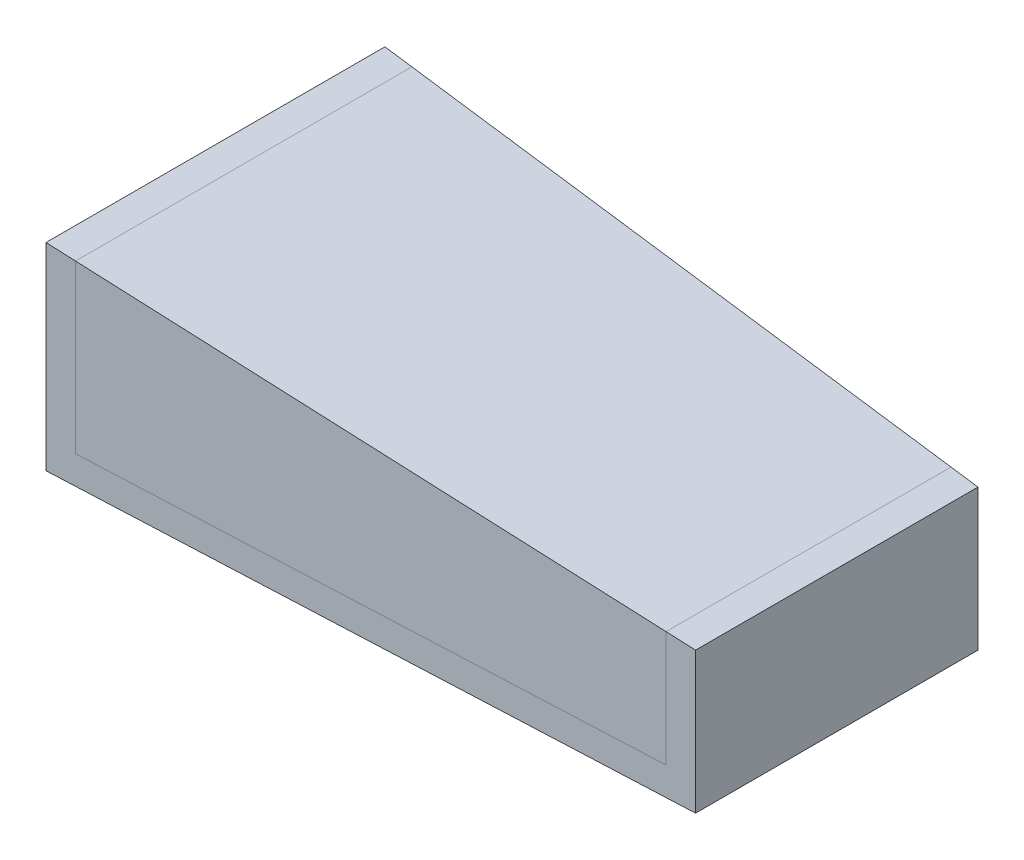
from build123d import *

# Parameters (mm, degrees)
BOSS_EXTRUDE1_DEPTH    = 60
CUT_EXTRUDE1_DEPTH     = 120
SPLIT1_SURFACE_1_BACK  = 261.192
SPLIT1_SURFACE_1_DEPTH = 522.384
SPLIT1_SURFACE_2_BACK  = 261.192
SPLIT1_SURFACE_2_DEPTH = 522.384


with BuildPart() as part:
    # Sketch1 → Boss-Extrude1 (new, symmetric)
    with BuildSketch(Plane.XY):
        Polygon((0, 0), (220, 0), (220, 50), (0, 70), align=None)
    extrude(amount=BOSS_EXTRUDE1_DEPTH, both=True)

    # Sketch2 → Cut-Extrude1 (cut)
    with BuildSketch(Plane(origin=(0, 0, 0), x_dir=(-1, 0, 0), z_dir=(0, -1, 0))):
        Polygon((0, -60), (-220, -60), (-220, -50), align=None)
    cut_extrude1 = extrude(amount=-CUT_EXTRUDE1_DEPTH, mode=Mode.SUBTRACT)

    # Mirror1: Cut-Extrude1 across plane
    add(cut_extrude1.mirror(Plane(origin=(0, 0, 0), x_dir=(1, 0, 0), z_dir=(0, 0, -1))), mode=Mode.SUBTRACT)


with BuildPart() as body_2:
    # Split1: the piece behind the surface
    add(part.part)
    # Split1 surface: a surface, the sketch's curves swept straight by 522.384 mm
    with BuildLine(Plane(origin=(0, 0, 0), x_dir=(-1, 0, 0), z_dir=(0, 0, -1)).offset(-SPLIT1_SURFACE_1_BACK), mode=Mode.PRIVATE) as split1_surface_1_path:
        Line((-10, 96.028572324), (-210, 96.028572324))
        Line((-210, 96.028572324), (-210, 10))
        Line((-210, 10), (-10, 10))
        Line((-10, 10), (-10, 96.028572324))
    split1_surface_1 = Shell.extrude(split1_surface_1_path.wire(), (0 * SPLIT1_SURFACE_1_DEPTH, 0 * SPLIT1_SURFACE_1_DEPTH, -1 * SPLIT1_SURFACE_1_DEPTH))
    split(bisect_by=split1_surface_1, keep=Keep.BOTTOM)


with BuildPart() as part_1:
    add(part.part)

    # Split1: split by a surface, the side it looks to stays
    # Split1 surface: a surface, the sketch's curves swept straight by 522.384 mm
    with BuildLine(Plane(origin=(0, 0, 0), x_dir=(-1, 0, 0), z_dir=(0, 0, -1)).offset(-SPLIT1_SURFACE_2_BACK), mode=Mode.PRIVATE) as split1_surface_2_path:
        Line((-10, 96.028572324), (-210, 96.028572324))
        Line((-210, 96.028572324), (-210, 10))
        Line((-210, 10), (-10, 10))
        Line((-10, 10), (-10, 96.028572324))
    split1_surface_2 = Shell.extrude(split1_surface_2_path.wire(), (0 * SPLIT1_SURFACE_2_DEPTH, 0 * SPLIT1_SURFACE_2_DEPTH, -1 * SPLIT1_SURFACE_2_DEPTH))
    split(bisect_by=split1_surface_2, keep=Keep.TOP)


solid = Compound([body_2.part, part_1.part])
